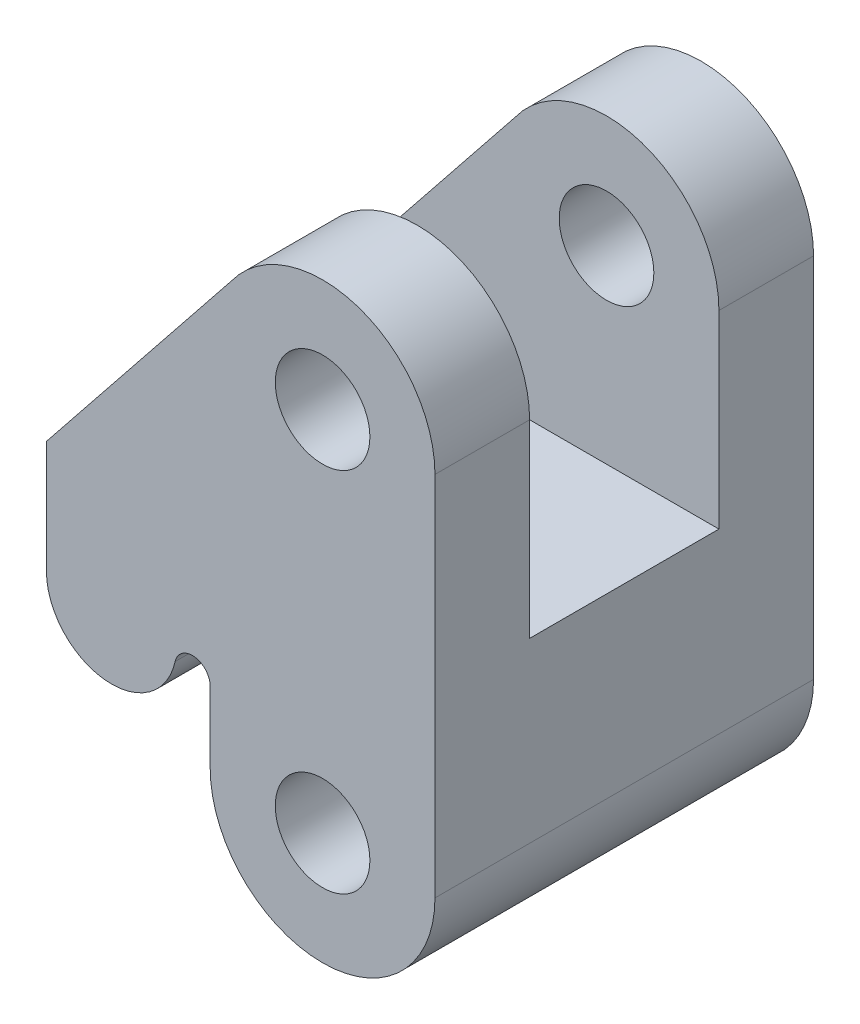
ISO-10303-21;
HEADER;
FILE_DESCRIPTION(('STEP AP214'),'2;1');
FILE_NAME('part.step','',(''),(''),'','','');
FILE_SCHEMA(('AUTOMOTIVE_DESIGN { 1 0 10303 214 1 1 1 1 }'));
ENDSEC;
DATA;
#1=APPLICATION_CONTEXT('core data for automotive mechanical design processes');
#2=APPLICATION_PROTOCOL_DEFINITION('international standard','automotive_design',2000,#1);
#3=PRODUCT_CONTEXT('',#1,'mechanical');
#4=PRODUCT('Part','Part','',(#3));
#5=PRODUCT_RELATED_PRODUCT_CATEGORY('part','',(#4));
#6=PRODUCT_DEFINITION_FORMATION('','',#4);
#7=PRODUCT_DEFINITION_CONTEXT('part definition',#1,'design');
#8=PRODUCT_DEFINITION('design','',#6,#7);
#9=PRODUCT_DEFINITION_SHAPE('','',#8);
#10=(LENGTH_UNIT() NAMED_UNIT(*) SI_UNIT(.MILLI.,.METRE.));
#11=(NAMED_UNIT(*) PLANE_ANGLE_UNIT() SI_UNIT($,.RADIAN.));
#12=(NAMED_UNIT(*) SI_UNIT($,.STERADIAN.) SOLID_ANGLE_UNIT());
#13=UNCERTAINTY_MEASURE_WITH_UNIT(LENGTH_MEASURE(1.E-05),#10,'distance_accuracy_value','');
#14=(GEOMETRIC_REPRESENTATION_CONTEXT(3) GLOBAL_UNCERTAINTY_ASSIGNED_CONTEXT((#13)) GLOBAL_UNIT_ASSIGNED_CONTEXT((#10,
#11,#12)) REPRESENTATION_CONTEXT('',''));
#15=CARTESIAN_POINT('',(0.,0.,0.));
#16=DIRECTION('',(0.,0.,1.));
#17=DIRECTION('',(1.,0.,0.));
#18=AXIS2_PLACEMENT_3D('',#15,#16,#17);
#19=CARTESIAN_POINT('',(-70.,34.0535829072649,32.));
#20=DIRECTION('',(0.,1.,0.));
#21=DIRECTION('',(-1.,0.,0.));
#22=AXIS2_PLACEMENT_3D('',#19,#20,#21);
#23=PLANE('',#22);
#24=DIRECTION('',(1.,0.,0.));
#25=VECTOR('',#24,1.);
#26=CARTESIAN_POINT('',(-70.,34.0535829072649,8.));
#27=LINE('',#26,#25);
#28=CARTESIAN_POINT('',(-70.,34.0535829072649,8.));
#29=VERTEX_POINT('',#28);
#30=CARTESIAN_POINT('',(-37.1597711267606,34.0535829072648,8.));
#31=VERTEX_POINT('',#30);
#32=EDGE_CURVE('E43',#29,#31,#27,.T.);
#33=ORIENTED_EDGE('',*,*,#32,.F.);
#34=DIRECTION('',(0.,0.,-1.));
#35=VECTOR('',#34,1.);
#36=CARTESIAN_POINT('',(-70.,34.0535829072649,32.));
#37=LINE('',#36,#35);
#38=CARTESIAN_POINT('',(-70.,34.0535829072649,24.));
#39=VERTEX_POINT('',#38);
#40=EDGE_CURVE('E128',#39,#29,#37,.T.);
#41=ORIENTED_EDGE('',*,*,#40,.F.);
#42=DIRECTION('',(1.,0.,0.));
#43=VECTOR('',#42,1.);
#44=CARTESIAN_POINT('',(-70.,34.0535829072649,24.));
#45=LINE('',#44,#43);
#46=CARTESIAN_POINT('',(-37.1597711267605,34.0535829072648,24.));
#47=VERTEX_POINT('',#46);
#48=EDGE_CURVE('E48',#39,#47,#45,.T.);
#49=ORIENTED_EDGE('',*,*,#48,.T.);
#50=DIRECTION('',(0.,0.,-1.));
#51=VECTOR('',#50,1.);
#52=CARTESIAN_POINT('',(-37.1597711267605,34.0535829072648,32.));
#53=LINE('',#52,#51);
#54=EDGE_CURVE('E36',#47,#31,#53,.T.);
#55=ORIENTED_EDGE('',*,*,#54,.T.);
#56=EDGE_LOOP('',(#33,#41,#49,#55));
#57=FACE_BOUND('',#56,.T.);
#58=ADVANCED_FACE('F27',(#57),#23,.T.);
#59=CARTESIAN_POINT('',(-46.6597711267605,19.0535829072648,32.));
#60=DIRECTION('',(0.,0.,-1.));
#61=DIRECTION('',(-1.,0.,0.));
#62=AXIS2_PLACEMENT_3D('',#59,#60,#61);
#63=CYLINDRICAL_SURFACE('',#62,9.50000000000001);
#64=DIRECTION('',(0.,0.,-1.));
#65=VECTOR('',#64,1.);
#66=CARTESIAN_POINT('',(-37.1597711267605,19.0535829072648,32.));
#67=LINE('',#66,#65);
#68=CARTESIAN_POINT('',(-37.1597711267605,19.0535829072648,32.));
#69=VERTEX_POINT('',#68);
#70=CARTESIAN_POINT('',(-37.1597711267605,19.0535829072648,0.));
#71=VERTEX_POINT('',#70);
#72=EDGE_CURVE('E11',#69,#71,#67,.T.);
#73=ORIENTED_EDGE('',*,*,#72,.F.);
#74=CARTESIAN_POINT('',(-46.6597711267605,19.0535829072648,32.));
#75=DIRECTION('',(0.,0.,-1.));
#76=DIRECTION('',(-1.,0.,0.));
#77=AXIS2_PLACEMENT_3D('',#74,#75,#76);
#78=CIRCLE('',#77,9.50000000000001);
#79=CARTESIAN_POINT('',(-56.1597711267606,19.0535829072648,32.));
#80=VERTEX_POINT('',#79);
#81=EDGE_CURVE('E201',#69,#80,#78,.T.);
#82=ORIENTED_EDGE('',*,*,#81,.T.);
#83=DIRECTION('',(0.,0.,-1.));
#84=VECTOR('',#83,1.);
#85=CARTESIAN_POINT('',(-56.1597711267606,19.0535829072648,32.));
#86=LINE('',#85,#84);
#87=CARTESIAN_POINT('',(-56.1597711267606,19.0535829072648,0.));
#88=VERTEX_POINT('',#87);
#89=EDGE_CURVE('E217',#80,#88,#86,.T.);
#90=ORIENTED_EDGE('',*,*,#89,.T.);
#91=CARTESIAN_POINT('',(-46.6597711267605,19.0535829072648,0.));
#92=DIRECTION('',(0.,0.,-1.));
#93=DIRECTION('',(-1.,0.,0.));
#94=AXIS2_PLACEMENT_3D('',#91,#92,#93);
#95=CIRCLE('',#94,9.50000000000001);
#96=EDGE_CURVE('E185',#71,#88,#95,.T.);
#97=ORIENTED_EDGE('',*,*,#96,.F.);
#98=EDGE_LOOP('',(#73,#82,#90,#97));
#99=FACE_BOUND('',#98,.T.);
#100=ADVANCED_FACE('F267',(#99),#63,.T.);
#101=CARTESIAN_POINT('',(-37.1597711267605,19.0535829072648,32.));
#102=DIRECTION('',(-1.,0.,0.));
#103=DIRECTION('',(0.,0.,1.));
#104=AXIS2_PLACEMENT_3D('',#101,#102,#103);
#105=PLANE('',#104);
#106=DIRECTION('',(0.,1.,0.));
#107=VECTOR('',#106,1.);
#108=CARTESIAN_POINT('',(-37.1597711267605,19.0535829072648,0.));
#109=LINE('',#108,#107);
#110=CARTESIAN_POINT('',(-37.1597711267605,50.0535829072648,0.));
#111=VERTEX_POINT('',#110);
#112=EDGE_CURVE('E199',#71,#111,#109,.T.);
#113=ORIENTED_EDGE('',*,*,#112,.T.);
#114=DIRECTION('',(0.,0.,1.));
#115=VECTOR('',#114,1.);
#116=CARTESIAN_POINT('',(-37.1597711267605,50.0535829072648,0.));
#117=LINE('',#116,#115);
#118=CARTESIAN_POINT('',(-37.1597711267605,50.0535829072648,8.));
#119=VERTEX_POINT('',#118);
#120=EDGE_CURVE('E155',#111,#119,#117,.T.);
#121=ORIENTED_EDGE('',*,*,#120,.T.);
#122=DIRECTION('',(0.,1.,0.));
#123=VECTOR('',#122,1.);
#124=CARTESIAN_POINT('',(-37.1597711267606,30.29709971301,8.));
#125=LINE('',#124,#123);
#126=EDGE_CURVE('E146',#31,#119,#125,.T.);
#127=ORIENTED_EDGE('',*,*,#126,.F.);
#128=ORIENTED_EDGE('',*,*,#54,.F.);
#129=DIRECTION('',(0.,1.,0.));
#130=VECTOR('',#129,1.);
#131=CARTESIAN_POINT('',(-37.1597711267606,30.29709971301,24.));
#132=LINE('',#131,#130);
#133=CARTESIAN_POINT('',(-37.1597711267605,50.0535829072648,24.));
#134=VERTEX_POINT('',#133);
#135=EDGE_CURVE('E174',#47,#134,#132,.T.);
#136=ORIENTED_EDGE('',*,*,#135,.T.);
#137=DIRECTION('',(0.,0.,1.));
#138=VECTOR('',#137,1.);
#139=CARTESIAN_POINT('',(-37.1597711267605,50.0535829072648,24.));
#140=LINE('',#139,#138);
#141=CARTESIAN_POINT('',(-37.1597711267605,50.0535829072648,32.));
#142=VERTEX_POINT('',#141);
#143=EDGE_CURVE('E176',#134,#142,#140,.T.);
#144=ORIENTED_EDGE('',*,*,#143,.T.);
#145=DIRECTION('',(0.,1.,0.));
#146=VECTOR('',#145,1.);
#147=CARTESIAN_POINT('',(-37.1597711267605,19.0535829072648,32.));
#148=LINE('',#147,#146);
#149=EDGE_CURVE('E215',#69,#142,#148,.T.);
#150=ORIENTED_EDGE('',*,*,#149,.F.);
#151=ORIENTED_EDGE('',*,*,#72,.T.);
#152=EDGE_LOOP('',(#113,#121,#127,#128,#136,#144,#150,#151));
#153=FACE_BOUND('',#152,.T.);
#154=ADVANCED_FACE('F29',(#153),#105,.F.);
#155=CARTESIAN_POINT('',(-70.,26.540616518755,32.));
#156=DIRECTION('',(-1.,0.,0.));
#157=DIRECTION('',(0.,0.,1.));
#158=AXIS2_PLACEMENT_3D('',#155,#156,#157);
#159=PLANE('',#158);
#160=DIRECTION('',(0.,0.,1.));
#161=VECTOR('',#160,1.);
#162=CARTESIAN_POINT('',(-70.,36.0535829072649,0.));
#163=LINE('',#162,#161);
#164=CARTESIAN_POINT('',(-70.,36.0535829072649,0.));
#165=VERTEX_POINT('',#164);
#166=CARTESIAN_POINT('',(-70.,36.0535829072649,8.));
#167=VERTEX_POINT('',#166);
#168=EDGE_CURVE('E125',#165,#167,#163,.T.);
#169=ORIENTED_EDGE('',*,*,#168,.F.);
#170=DIRECTION('',(0.,1.,0.));
#171=VECTOR('',#170,1.);
#172=CARTESIAN_POINT('',(-70.,26.540616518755,0.));
#173=LINE('',#172,#171);
#174=CARTESIAN_POINT('',(-70.,26.540616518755,0.));
#175=VERTEX_POINT('',#174);
#176=EDGE_CURVE('E197',#175,#165,#173,.T.);
#177=ORIENTED_EDGE('',*,*,#176,.F.);
#178=DIRECTION('',(0.,0.,-1.));
#179=VECTOR('',#178,1.);
#180=CARTESIAN_POINT('',(-70.,26.540616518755,32.));
#181=LINE('',#180,#179);
#182=CARTESIAN_POINT('',(-70.,26.540616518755,32.));
#183=VERTEX_POINT('',#182);
#184=EDGE_CURVE('E223',#183,#175,#181,.T.);
#185=ORIENTED_EDGE('',*,*,#184,.F.);
#186=DIRECTION('',(0.,1.,0.));
#187=VECTOR('',#186,1.);
#188=CARTESIAN_POINT('',(-70.,26.540616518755,32.));
#189=LINE('',#188,#187);
#190=CARTESIAN_POINT('',(-70.,36.0535829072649,32.));
#191=VERTEX_POINT('',#190);
#192=EDGE_CURVE('E213',#183,#191,#189,.T.);
#193=ORIENTED_EDGE('',*,*,#192,.T.);
#194=DIRECTION('',(0.,0.,1.));
#195=VECTOR('',#194,1.);
#196=CARTESIAN_POINT('',(-70.,36.0535829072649,24.));
#197=LINE('',#196,#195);
#198=CARTESIAN_POINT('',(-70.,36.0535829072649,24.));
#199=VERTEX_POINT('',#198);
#200=EDGE_CURVE('E181',#199,#191,#197,.T.);
#201=ORIENTED_EDGE('',*,*,#200,.F.);
#202=DIRECTION('',(0.,1.,0.));
#203=VECTOR('',#202,1.);
#204=CARTESIAN_POINT('',(-70.,30.2970997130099,24.));
#205=LINE('',#204,#203);
#206=EDGE_CURVE('E166',#39,#199,#205,.T.);
#207=ORIENTED_EDGE('',*,*,#206,.F.);
#208=ORIENTED_EDGE('',*,*,#40,.T.);
#209=DIRECTION('',(0.,1.,0.));
#210=VECTOR('',#209,1.);
#211=CARTESIAN_POINT('',(-70.,30.2970997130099,8.));
#212=LINE('',#211,#210);
#213=EDGE_CURVE('E121',#29,#167,#212,.T.);
#214=ORIENTED_EDGE('',*,*,#213,.T.);
#215=EDGE_LOOP('',(#169,#177,#185,#193,#201,#207,#208,#214));
#216=FACE_BOUND('',#215,.T.);
#217=ADVANCED_FACE('F123',(#216),#159,.T.);
#218=CARTESIAN_POINT('',(-64.5,26.540616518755,32.));
#219=DIRECTION('',(0.,0.,-1.));
#220=DIRECTION('',(-1.,0.,0.));
#221=AXIS2_PLACEMENT_3D('',#218,#219,#220);
#222=CYLINDRICAL_SURFACE('',#221,5.5);
#223=DIRECTION('',(0.,0.,-1.));
#224=VECTOR('',#223,1.);
#225=CARTESIAN_POINT('',(-59.1255344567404,25.3722329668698,32.));
#226=LINE('',#225,#224);
#227=CARTESIAN_POINT('',(-59.1255344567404,25.3722329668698,32.));
#228=VERTEX_POINT('',#227);
#229=CARTESIAN_POINT('',(-59.1255344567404,25.3722329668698,0.));
#230=VERTEX_POINT('',#229);
#231=EDGE_CURVE('E221',#228,#230,#226,.T.);
#232=ORIENTED_EDGE('',*,*,#231,.F.);
#233=CARTESIAN_POINT('',(-64.5,26.540616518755,32.));
#234=DIRECTION('',(0.,0.,-1.));
#235=DIRECTION('',(-1.,0.,0.));
#236=AXIS2_PLACEMENT_3D('',#233,#234,#235);
#237=CIRCLE('',#236,5.5);
#238=EDGE_CURVE('E210',#228,#183,#237,.T.);
#239=ORIENTED_EDGE('',*,*,#238,.T.);
#240=ORIENTED_EDGE('',*,*,#184,.T.);
#241=CARTESIAN_POINT('',(-64.5,26.540616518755,0.));
#242=DIRECTION('',(0.,0.,-1.));
#243=DIRECTION('',(-1.,0.,0.));
#244=AXIS2_PLACEMENT_3D('',#241,#242,#243);
#245=CIRCLE('',#244,5.5);
#246=EDGE_CURVE('E194',#230,#175,#245,.T.);
#247=ORIENTED_EDGE('',*,*,#246,.F.);
#248=EDGE_LOOP('',(#232,#239,#240,#247));
#249=FACE_BOUND('',#248,.T.);
#250=ADVANCED_FACE('F241',(#249),#222,.T.);
#251=CARTESIAN_POINT('',(-57.6597711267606,25.0535829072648,32.));
#252=DIRECTION('',(0.,0.,-1.));
#253=DIRECTION('',(-1.,0.,0.));
#254=AXIS2_PLACEMENT_3D('',#251,#252,#253);
#255=CYLINDRICAL_SURFACE('',#254,1.5);
#256=DIRECTION('',(0.,0.,-1.));
#257=VECTOR('',#256,1.);
#258=CARTESIAN_POINT('',(-56.1597711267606,25.0535829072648,32.));
#259=LINE('',#258,#257);
#260=CARTESIAN_POINT('',(-56.1597711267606,25.0535829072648,32.));
#261=VERTEX_POINT('',#260);
#262=CARTESIAN_POINT('',(-56.1597711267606,25.0535829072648,0.));
#263=VERTEX_POINT('',#262);
#264=EDGE_CURVE('E219',#261,#263,#259,.T.);
#265=ORIENTED_EDGE('',*,*,#264,.F.);
#266=CARTESIAN_POINT('',(-57.6597711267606,25.0535829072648,32.));
#267=DIRECTION('',(0.,0.,1.));
#268=DIRECTION('',(1.,0.,0.));
#269=AXIS2_PLACEMENT_3D('',#266,#267,#268);
#270=CIRCLE('',#269,1.5);
#271=EDGE_CURVE('E207',#261,#228,#270,.T.);
#272=ORIENTED_EDGE('',*,*,#271,.T.);
#273=ORIENTED_EDGE('',*,*,#231,.T.);
#274=CARTESIAN_POINT('',(-57.6597711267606,25.0535829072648,0.));
#275=DIRECTION('',(0.,0.,1.));
#276=DIRECTION('',(1.,0.,0.));
#277=AXIS2_PLACEMENT_3D('',#274,#275,#276);
#278=CIRCLE('',#277,1.5);
#279=EDGE_CURVE('E191',#263,#230,#278,.T.);
#280=ORIENTED_EDGE('',*,*,#279,.F.);
#281=EDGE_LOOP('',(#265,#272,#273,#280));
#282=FACE_BOUND('',#281,.T.);
#283=ADVANCED_FACE('F278',(#282),#255,.F.);
#284=CARTESIAN_POINT('',(-56.1597711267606,19.0535829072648,32.));
#285=DIRECTION('',(-1.,0.,0.));
#286=DIRECTION('',(0.,0.,1.));
#287=AXIS2_PLACEMENT_3D('',#284,#285,#286);
#288=PLANE('',#287);
#289=DIRECTION('',(0.,1.,0.));
#290=VECTOR('',#289,1.);
#291=CARTESIAN_POINT('',(-56.1597711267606,19.0535829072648,32.));
#292=LINE('',#291,#290);
#293=EDGE_CURVE('E204',#80,#261,#292,.T.);
#294=ORIENTED_EDGE('',*,*,#293,.T.);
#295=ORIENTED_EDGE('',*,*,#264,.T.);
#296=DIRECTION('',(0.,1.,0.));
#297=VECTOR('',#296,1.);
#298=CARTESIAN_POINT('',(-56.1597711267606,19.0535829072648,0.));
#299=LINE('',#298,#297);
#300=EDGE_CURVE('E188',#88,#263,#299,.T.);
#301=ORIENTED_EDGE('',*,*,#300,.F.);
#302=ORIENTED_EDGE('',*,*,#89,.F.);
#303=EDGE_LOOP('',(#294,#295,#301,#302));
#304=FACE_BOUND('',#303,.T.);
#305=ADVANCED_FACE('F281',(#304),#288,.T.);
#306=CARTESIAN_POINT('',(-46.6597711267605,19.0535829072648,32.));
#307=DIRECTION('',(0.,0.,-1.));
#308=DIRECTION('',(-1.,0.,0.));
#309=AXIS2_PLACEMENT_3D('',#306,#307,#308);
#310=PLANE('',#309);
#311=CARTESIAN_POINT('',(-46.6597711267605,19.0535829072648,32.));
#312=DIRECTION('',(0.,0.,1.));
#313=DIRECTION('',(1.,0.,0.));
#314=AXIS2_PLACEMENT_3D('',#311,#312,#313);
#315=CIRCLE('',#314,4.00000000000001);
#316=CARTESIAN_POINT('',(-42.6597711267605,19.0535829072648,32.));
#317=VERTEX_POINT('',#316);
#318=EDGE_CURVE('E419',#317,#317,#315,.T.);
#319=ORIENTED_EDGE('',*,*,#318,.F.);
#320=EDGE_LOOP('',(#319));
#321=FACE_BOUND('',#320,.T.);
#322=CARTESIAN_POINT('',(-46.6597711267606,50.0535829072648,32.));
#323=DIRECTION('',(0.,0.,1.));
#324=DIRECTION('',(1.,0.,0.));
#325=AXIS2_PLACEMENT_3D('',#322,#323,#324);
#326=CIRCLE('',#325,4.);
#327=CARTESIAN_POINT('',(-42.6597711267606,50.0535829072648,32.));
#328=VERTEX_POINT('',#327);
#329=EDGE_CURVE('E301',#328,#328,#326,.T.);
#330=ORIENTED_EDGE('',*,*,#329,.F.);
#331=EDGE_LOOP('',(#330));
#332=FACE_BOUND('',#331,.T.);
#333=ORIENTED_EDGE('',*,*,#149,.T.);
#334=CARTESIAN_POINT('',(-46.6597711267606,50.0535829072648,32.));
#335=DIRECTION('',(0.,0.,1.));
#336=DIRECTION('',(1.,0.,0.));
#337=AXIS2_PLACEMENT_3D('',#334,#335,#336);
#338=CIRCLE('',#337,9.50000000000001);
#339=CARTESIAN_POINT('',(-54.3470288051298,55.6353451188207,32.));
#340=VERTEX_POINT('',#339);
#341=EDGE_CURVE('E163',#142,#340,#338,.T.);
#342=ORIENTED_EDGE('',*,*,#341,.T.);
#343=DIRECTION('',(0.62439245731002,0.781110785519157,0.));
#344=VECTOR('',#343,1.);
#345=CARTESIAN_POINT('',(-70.,36.0535829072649,32.));
#346=LINE('',#345,#344);
#347=EDGE_CURVE('E160',#191,#340,#346,.T.);
#348=ORIENTED_EDGE('',*,*,#347,.F.);
#349=ORIENTED_EDGE('',*,*,#192,.F.);
#350=ORIENTED_EDGE('',*,*,#238,.F.);
#351=ORIENTED_EDGE('',*,*,#271,.F.);
#352=ORIENTED_EDGE('',*,*,#293,.F.);
#353=ORIENTED_EDGE('',*,*,#81,.F.);
#354=EDGE_LOOP('',(#333,#342,#348,#349,#350,#351,#352,#353));
#355=FACE_BOUND('',#354,.T.);
#356=ADVANCED_FACE('F245',(#321,#332,#355),#310,.F.);
#357=CARTESIAN_POINT('',(-46.6597711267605,19.0535829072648,0.));
#358=DIRECTION('',(0.,0.,-1.));
#359=DIRECTION('',(-1.,0.,0.));
#360=AXIS2_PLACEMENT_3D('',#357,#358,#359);
#361=PLANE('',#360);
#362=CARTESIAN_POINT('',(-46.6597711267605,19.0535829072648,0.));
#363=DIRECTION('',(0.,0.,1.));
#364=DIRECTION('',(1.,0.,0.));
#365=AXIS2_PLACEMENT_3D('',#362,#363,#364);
#366=CIRCLE('',#365,4.00000000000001);
#367=CARTESIAN_POINT('',(-42.6597711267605,19.0535829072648,0.));
#368=VERTEX_POINT('',#367);
#369=EDGE_CURVE('E296',#368,#368,#366,.T.);
#370=ORIENTED_EDGE('',*,*,#369,.T.);
#371=EDGE_LOOP('',(#370));
#372=FACE_BOUND('',#371,.T.);
#373=CARTESIAN_POINT('',(-46.6597711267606,50.0535829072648,0.));
#374=DIRECTION('',(0.,0.,1.));
#375=DIRECTION('',(1.,0.,0.));
#376=AXIS2_PLACEMENT_3D('',#373,#374,#375);
#377=CIRCLE('',#376,4.);
#378=CARTESIAN_POINT('',(-42.6597711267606,50.0535829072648,0.));
#379=VERTEX_POINT('',#378);
#380=EDGE_CURVE('E299',#379,#379,#377,.T.);
#381=ORIENTED_EDGE('',*,*,#380,.T.);
#382=EDGE_LOOP('',(#381));
#383=FACE_BOUND('',#382,.T.);
#384=ORIENTED_EDGE('',*,*,#176,.T.);
#385=DIRECTION('',(0.62439245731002,0.781110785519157,0.));
#386=VECTOR('',#385,1.);
#387=CARTESIAN_POINT('',(-70.,36.0535829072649,0.));
#388=LINE('',#387,#386);
#389=CARTESIAN_POINT('',(-54.3470288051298,55.6353451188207,0.));
#390=VERTEX_POINT('',#389);
#391=EDGE_CURVE('E139',#165,#390,#388,.T.);
#392=ORIENTED_EDGE('',*,*,#391,.T.);
#393=CARTESIAN_POINT('',(-46.6597711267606,50.0535829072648,0.));
#394=DIRECTION('',(0.,0.,1.));
#395=DIRECTION('',(1.,0.,0.));
#396=AXIS2_PLACEMENT_3D('',#393,#394,#395);
#397=CIRCLE('',#396,9.50000000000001);
#398=EDGE_CURVE('E152',#111,#390,#397,.T.);
#399=ORIENTED_EDGE('',*,*,#398,.F.);
#400=ORIENTED_EDGE('',*,*,#112,.F.);
#401=ORIENTED_EDGE('',*,*,#96,.T.);
#402=ORIENTED_EDGE('',*,*,#300,.T.);
#403=ORIENTED_EDGE('',*,*,#279,.T.);
#404=ORIENTED_EDGE('',*,*,#246,.T.);
#405=EDGE_LOOP('',(#384,#392,#399,#400,#401,#402,#403,#404));
#406=FACE_BOUND('',#405,.T.);
#407=ADVANCED_FACE('F235',(#372,#383,#406),#361,.T.);
#408=CARTESIAN_POINT('',(-70.,36.0535829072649,24.));
#409=DIRECTION('',(0.781110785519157,-0.62439245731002,0.));
#410=DIRECTION('',(0.62439245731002,0.781110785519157,0.));
#411=AXIS2_PLACEMENT_3D('',#408,#409,#410);
#412=PLANE('',#411);
#413=DIRECTION('',(0.,0.,1.));
#414=VECTOR('',#413,1.);
#415=CARTESIAN_POINT('',(-54.3470288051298,55.6353451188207,24.));
#416=LINE('',#415,#414);
#417=CARTESIAN_POINT('',(-54.3470288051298,55.6353451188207,24.));
#418=VERTEX_POINT('',#417);
#419=EDGE_CURVE('E179',#418,#340,#416,.T.);
#420=ORIENTED_EDGE('',*,*,#419,.F.);
#421=DIRECTION('',(0.62439245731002,0.781110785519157,0.));
#422=VECTOR('',#421,1.);
#423=CARTESIAN_POINT('',(-70.,36.0535829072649,24.));
#424=LINE('',#423,#422);
#425=EDGE_CURVE('E168',#199,#418,#424,.T.);
#426=ORIENTED_EDGE('',*,*,#425,.F.);
#427=ORIENTED_EDGE('',*,*,#200,.T.);
#428=ORIENTED_EDGE('',*,*,#347,.T.);
#429=EDGE_LOOP('',(#420,#426,#427,#428));
#430=FACE_BOUND('',#429,.T.);
#431=ADVANCED_FACE('F248',(#430),#412,.F.);
#432=CARTESIAN_POINT('',(-46.6597711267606,50.0535829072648,24.));
#433=DIRECTION('',(0.,0.,1.));
#434=DIRECTION('',(1.,0.,0.));
#435=AXIS2_PLACEMENT_3D('',#432,#433,#434);
#436=CYLINDRICAL_SURFACE('',#435,9.50000000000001);
#437=ORIENTED_EDGE('',*,*,#143,.F.);
#438=CARTESIAN_POINT('',(-46.6597711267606,50.0535829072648,24.));
#439=DIRECTION('',(0.,0.,1.));
#440=DIRECTION('',(1.,0.,0.));
#441=AXIS2_PLACEMENT_3D('',#438,#439,#440);
#442=CIRCLE('',#441,9.50000000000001);
#443=EDGE_CURVE('E171',#134,#418,#442,.T.);
#444=ORIENTED_EDGE('',*,*,#443,.T.);
#445=ORIENTED_EDGE('',*,*,#419,.T.);
#446=ORIENTED_EDGE('',*,*,#341,.F.);
#447=EDGE_LOOP('',(#437,#444,#445,#446));
#448=FACE_BOUND('',#447,.T.);
#449=ADVANCED_FACE('F256',(#448),#436,.T.);
#450=CARTESIAN_POINT('',(-46.6597711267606,50.0535829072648,24.));
#451=DIRECTION('',(0.,0.,1.));
#452=DIRECTION('',(1.,0.,0.));
#453=AXIS2_PLACEMENT_3D('',#450,#451,#452);
#454=PLANE('',#453);
#455=CARTESIAN_POINT('',(-46.6597711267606,50.0535829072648,24.));
#456=DIRECTION('',(0.,0.,1.));
#457=DIRECTION('',(1.,0.,0.));
#458=AXIS2_PLACEMENT_3D('',#455,#456,#457);
#459=CIRCLE('',#458,4.);
#460=CARTESIAN_POINT('',(-42.6597711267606,50.0535829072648,24.));
#461=VERTEX_POINT('',#460);
#462=EDGE_CURVE('E132',#461,#461,#459,.T.);
#463=ORIENTED_EDGE('',*,*,#462,.T.);
#464=EDGE_LOOP('',(#463));
#465=FACE_BOUND('',#464,.T.);
#466=ORIENTED_EDGE('',*,*,#48,.F.);
#467=ORIENTED_EDGE('',*,*,#206,.T.);
#468=ORIENTED_EDGE('',*,*,#425,.T.);
#469=ORIENTED_EDGE('',*,*,#443,.F.);
#470=ORIENTED_EDGE('',*,*,#135,.F.);
#471=EDGE_LOOP('',(#466,#467,#468,#469,#470));
#472=FACE_BOUND('',#471,.T.);
#473=ADVANCED_FACE('F251',(#465,#472),#454,.F.);
#474=CARTESIAN_POINT('',(-70.,36.0535829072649,0.));
#475=DIRECTION('',(0.781110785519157,-0.62439245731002,0.));
#476=DIRECTION('',(0.62439245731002,0.781110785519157,0.));
#477=AXIS2_PLACEMENT_3D('',#474,#475,#476);
#478=PLANE('',#477);
#479=DIRECTION('',(0.,0.,1.));
#480=VECTOR('',#479,1.);
#481=CARTESIAN_POINT('',(-54.3470288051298,55.6353451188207,0.));
#482=LINE('',#481,#480);
#483=CARTESIAN_POINT('',(-54.3470288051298,55.6353451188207,8.));
#484=VERTEX_POINT('',#483);
#485=EDGE_CURVE('E140',#390,#484,#482,.T.);
#486=ORIENTED_EDGE('',*,*,#485,.F.);
#487=ORIENTED_EDGE('',*,*,#391,.F.);
#488=ORIENTED_EDGE('',*,*,#168,.T.);
#489=DIRECTION('',(0.62439245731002,0.781110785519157,0.));
#490=VECTOR('',#489,1.);
#491=CARTESIAN_POINT('',(-70.,36.0535829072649,8.));
#492=LINE('',#491,#490);
#493=EDGE_CURVE('E131',#167,#484,#492,.T.);
#494=ORIENTED_EDGE('',*,*,#493,.T.);
#495=EDGE_LOOP('',(#486,#487,#488,#494));
#496=FACE_BOUND('',#495,.T.);
#497=ADVANCED_FACE('F136',(#496),#478,.F.);
#498=CARTESIAN_POINT('',(-46.6597711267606,50.0535829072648,0.));
#499=DIRECTION('',(0.,0.,1.));
#500=DIRECTION('',(1.,0.,0.));
#501=AXIS2_PLACEMENT_3D('',#498,#499,#500);
#502=CYLINDRICAL_SURFACE('',#501,9.50000000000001);
#503=ORIENTED_EDGE('',*,*,#120,.F.);
#504=ORIENTED_EDGE('',*,*,#398,.T.);
#505=ORIENTED_EDGE('',*,*,#485,.T.);
#506=CARTESIAN_POINT('',(-46.6597711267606,50.0535829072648,8.));
#507=DIRECTION('',(0.,0.,1.));
#508=DIRECTION('',(1.,0.,0.));
#509=AXIS2_PLACEMENT_3D('',#506,#507,#508);
#510=CIRCLE('',#509,9.50000000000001);
#511=EDGE_CURVE('E144',#119,#484,#510,.T.);
#512=ORIENTED_EDGE('',*,*,#511,.F.);
#513=EDGE_LOOP('',(#503,#504,#505,#512));
#514=FACE_BOUND('',#513,.T.);
#515=ADVANCED_FACE('F233',(#514),#502,.T.);
#516=CARTESIAN_POINT('',(-46.6597711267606,50.0535829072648,8.));
#517=DIRECTION('',(0.,0.,1.));
#518=DIRECTION('',(1.,0.,0.));
#519=AXIS2_PLACEMENT_3D('',#516,#517,#518);
#520=PLANE('',#519);
#521=CARTESIAN_POINT('',(-46.6597711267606,50.0535829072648,8.));
#522=DIRECTION('',(0.,0.,1.));
#523=DIRECTION('',(1.,0.,0.));
#524=AXIS2_PLACEMENT_3D('',#521,#522,#523);
#525=CIRCLE('',#524,4.);
#526=CARTESIAN_POINT('',(-42.6597711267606,50.0535829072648,8.));
#527=VERTEX_POINT('',#526);
#528=EDGE_CURVE('E31',#527,#527,#525,.T.);
#529=ORIENTED_EDGE('',*,*,#528,.F.);
#530=EDGE_LOOP('',(#529));
#531=FACE_BOUND('',#530,.T.);
#532=ORIENTED_EDGE('',*,*,#213,.F.);
#533=ORIENTED_EDGE('',*,*,#32,.T.);
#534=ORIENTED_EDGE('',*,*,#126,.T.);
#535=ORIENTED_EDGE('',*,*,#511,.T.);
#536=ORIENTED_EDGE('',*,*,#493,.F.);
#537=EDGE_LOOP('',(#532,#533,#534,#535,#536));
#538=FACE_BOUND('',#537,.T.);
#539=ADVANCED_FACE('F142',(#531,#538),#520,.T.);
#540=CARTESIAN_POINT('',(-46.6597711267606,50.0535829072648,0.));
#541=DIRECTION('',(0.,0.,1.));
#542=DIRECTION('',(1.,0.,0.));
#543=AXIS2_PLACEMENT_3D('',#540,#541,#542);
#544=CYLINDRICAL_SURFACE('',#543,4.);
#545=ORIENTED_EDGE('',*,*,#528,.T.);
#546=EDGE_LOOP('',(#545));
#547=FACE_BOUND('',#546,.T.);
#548=ORIENTED_EDGE('',*,*,#380,.F.);
#549=EDGE_LOOP('',(#548));
#550=FACE_BOUND('',#549,.T.);
#551=ADVANCED_FACE('F313',(#547,#550),#544,.F.);
#552=ORIENTED_EDGE('',*,*,#329,.T.);
#553=EDGE_LOOP('',(#552));
#554=FACE_BOUND('',#553,.T.);
#555=ORIENTED_EDGE('',*,*,#462,.F.);
#556=EDGE_LOOP('',(#555));
#557=FACE_BOUND('',#556,.T.);
#558=ADVANCED_FACE('F310',(#554,#557),#544,.F.);
#559=CARTESIAN_POINT('',(-46.6597711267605,19.0535829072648,0.));
#560=DIRECTION('',(0.,0.,1.));
#561=DIRECTION('',(1.,0.,0.));
#562=AXIS2_PLACEMENT_3D('',#559,#560,#561);
#563=CYLINDRICAL_SURFACE('',#562,4.00000000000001);
#564=ORIENTED_EDGE('',*,*,#369,.F.);
#565=EDGE_LOOP('',(#564));
#566=FACE_BOUND('',#565,.T.);
#567=ORIENTED_EDGE('',*,*,#318,.T.);
#568=EDGE_LOOP('',(#567));
#569=FACE_BOUND('',#568,.T.);
#570=ADVANCED_FACE('F312',(#566,#569),#563,.F.);
#571=CLOSED_SHELL('',(#58,#100,#154,#217,#250,#283,#305,#356,#407,#431,#449,#473,#497,#515,#539,
#551,#558,#570));
#572=MANIFOLD_SOLID_BREP('B2',#571);
#573=ADVANCED_BREP_SHAPE_REPRESENTATION('',(#18,#572),#14);
#574=SHAPE_DEFINITION_REPRESENTATION(#9,#573);
ENDSEC;
END-ISO-10303-21;
